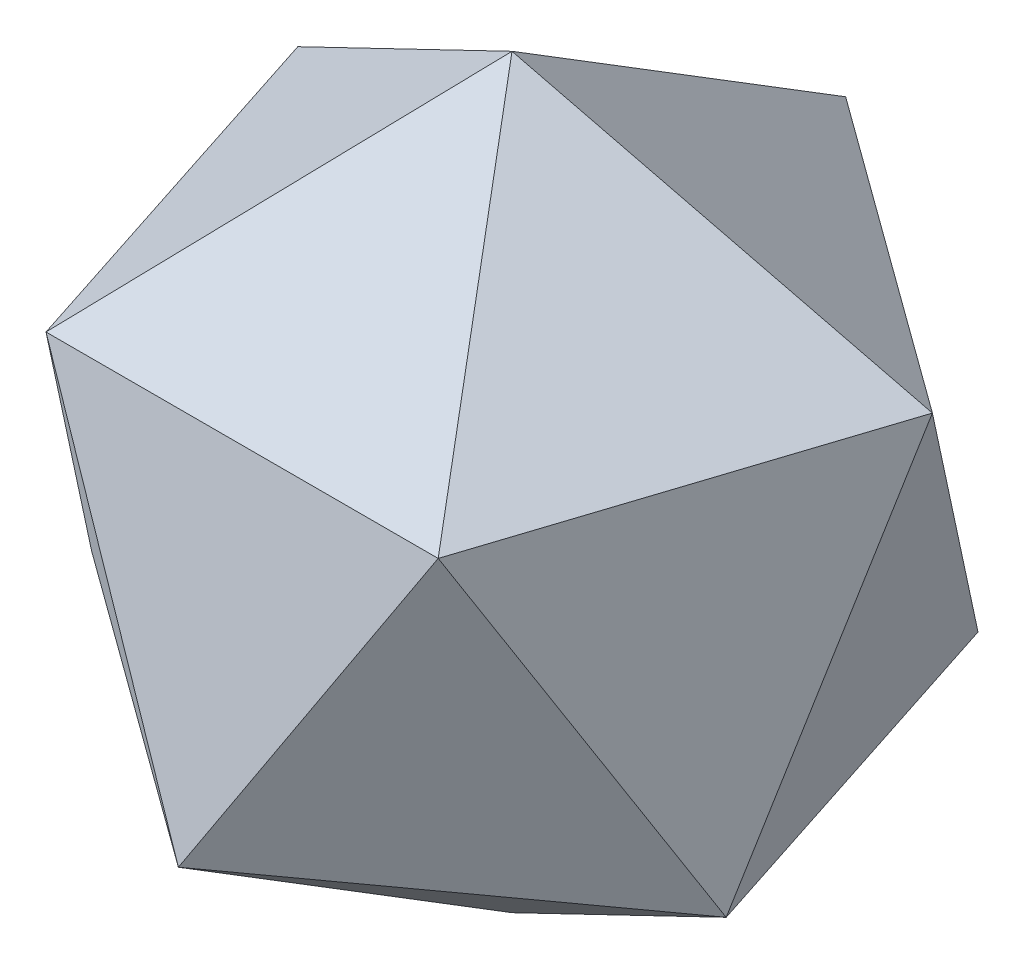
ISO-10303-21;
HEADER;
FILE_DESCRIPTION(('STEP AP214'),'2;1');
FILE_NAME('part.step','',(''),(''),'','','');
FILE_SCHEMA(('AUTOMOTIVE_DESIGN { 1 0 10303 214 1 1 1 1 }'));
ENDSEC;
DATA;
#1=APPLICATION_CONTEXT('core data for automotive mechanical design processes');
#2=APPLICATION_PROTOCOL_DEFINITION('international standard','automotive_design',2000,#1);
#3=PRODUCT_CONTEXT('',#1,'mechanical');
#4=PRODUCT('Part','Part','',(#3));
#5=PRODUCT_RELATED_PRODUCT_CATEGORY('part','',(#4));
#6=PRODUCT_DEFINITION_FORMATION('','',#4);
#7=PRODUCT_DEFINITION_CONTEXT('part definition',#1,'design');
#8=PRODUCT_DEFINITION('design','',#6,#7);
#9=PRODUCT_DEFINITION_SHAPE('','',#8);
#10=(LENGTH_UNIT() NAMED_UNIT(*) SI_UNIT(.MILLI.,.METRE.));
#11=(NAMED_UNIT(*) PLANE_ANGLE_UNIT() SI_UNIT($,.RADIAN.));
#12=(NAMED_UNIT(*) SI_UNIT($,.STERADIAN.) SOLID_ANGLE_UNIT());
#13=UNCERTAINTY_MEASURE_WITH_UNIT(LENGTH_MEASURE(1.E-05),#10,'distance_accuracy_value','');
#14=(GEOMETRIC_REPRESENTATION_CONTEXT(3) GLOBAL_UNCERTAINTY_ASSIGNED_CONTEXT((#13)) GLOBAL_UNIT_ASSIGNED_CONTEXT((#10,
#11,#12)) REPRESENTATION_CONTEXT('',''));
#15=CARTESIAN_POINT('',(0.,0.,0.));
#16=DIRECTION('',(0.,0.,1.));
#17=DIRECTION('',(1.,0.,0.));
#18=AXIS2_PLACEMENT_3D('',#15,#16,#17);
#19=CARTESIAN_POINT('',(-26.9672331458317,-60.056910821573,37.1172121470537));
#20=DIRECTION('',(-0.356822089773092,-0.794654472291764,0.491123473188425));
#21=DIRECTION('',(0.,-0.525731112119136,-0.850650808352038));
#22=AXIS2_PLACEMENT_3D('',#19,#20,#21);
#23=PLANE('',#22);
#24=DIRECTION('',(-0.809016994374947,0.,-0.587785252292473));
#25=VECTOR('',#24,1.);
#26=CARTESIAN_POINT('',(-40.4508497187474,-42.5325404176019,55.6758182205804));
#27=LINE('',#26,#25);
#28=CARTESIAN_POINT('',(0.,-42.5325404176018,85.0650808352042));
#29=VERTEX_POINT('',#28);
#30=CARTESIAN_POINT('',(-80.9016994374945,-42.5325404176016,26.2865556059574));
#31=VERTEX_POINT('',#30);
#32=EDGE_CURVE('E116',#29,#31,#27,.T.);
#33=ORIENTED_EDGE('',*,*,#32,.T.);
#34=DIRECTION('',(0.809016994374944,-0.525731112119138,-0.26286555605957));
#35=VECTOR('',#34,1.);
#36=CARTESIAN_POINT('',(-40.4508497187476,-68.8190960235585,13.1432778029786));
#37=LINE('',#36,#35);
#38=CARTESIAN_POINT('',(0.,-95.1056516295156,0.));
#39=VERTEX_POINT('',#38);
#40=EDGE_CURVE('E55',#31,#39,#37,.T.);
#41=ORIENTED_EDGE('',*,*,#40,.T.);
#42=DIRECTION('',(0.,0.525731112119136,0.850650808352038));
#43=VECTOR('',#42,1.);
#44=CARTESIAN_POINT('',(0.,-68.8190960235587,42.5325404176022));
#45=LINE('',#44,#43);
#46=EDGE_CURVE('E87',#39,#29,#45,.T.);
#47=ORIENTED_EDGE('',*,*,#46,.T.);
#48=EDGE_LOOP('',(#33,#41,#47));
#49=FACE_BOUND('',#48,.T.);
#50=ADVANCED_FACE('F33',(#49),#23,.T.);
#51=CARTESIAN_POINT('',(43.6338998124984,-14.1775134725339,60.056910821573));
#52=DIRECTION('',(-0.577350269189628,0.187592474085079,-0.794654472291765));
#53=DIRECTION('',(-0.809016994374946,0.,0.587785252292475));
#54=AXIS2_PLACEMENT_3D('',#51,#52,#53);
#55=PLANE('',#54);
#56=DIRECTION('',(-0.809016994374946,0.,0.587785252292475));
#57=VECTOR('',#56,1.);
#58=CARTESIAN_POINT('',(40.4508497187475,-42.5325404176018,55.6758182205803));
#59=LINE('',#58,#57);
#60=CARTESIAN_POINT('',(80.901699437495,-42.5325404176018,26.2865556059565));
#61=VERTEX_POINT('',#60);
#62=EDGE_CURVE('E92',#61,#29,#59,.T.);
#63=ORIENTED_EDGE('',*,*,#62,.F.);
#64=DIRECTION('',(-0.309016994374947,0.85065080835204,0.42532540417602));
#65=VECTOR('',#64,1.);
#66=CARTESIAN_POINT('',(65.4508497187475,1.09287578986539E-13,47.5528258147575));
#67=LINE('',#66,#65);
#68=CARTESIAN_POINT('',(50.,42.5325404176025,68.8190960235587));
#69=VERTEX_POINT('',#68);
#70=EDGE_CURVE('E149',#61,#69,#67,.T.);
#71=ORIENTED_EDGE('',*,*,#70,.T.);
#72=DIRECTION('',(0.499999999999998,0.850650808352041,-0.162459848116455));
#73=VECTOR('',#72,1.);
#74=CARTESIAN_POINT('',(25.0000000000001,1.00613961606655E-13,76.9420884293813));
#75=LINE('',#74,#73);
#76=EDGE_CURVE('E152',#29,#69,#75,.T.);
#77=ORIENTED_EDGE('',*,*,#76,.F.);
#78=EDGE_LOOP('',(#63,#71,#77));
#79=FACE_BOUND('',#78,.T.);
#80=ADVANCED_FACE('F204',(#79),#55,.F.);
#81=CARTESIAN_POINT('',(70.6011329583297,-14.1775134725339,-22.9396986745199));
#82=DIRECTION('',(-0.934172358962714,0.187592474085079,0.303530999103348));
#83=DIRECTION('',(0.309016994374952,0.,0.951056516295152));
#84=AXIS2_PLACEMENT_3D('',#81,#82,#83);
#85=PLANE('',#84);
#86=DIRECTION('',(0.309016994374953,0.,0.951056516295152));
#87=VECTOR('',#86,1.);
#88=CARTESIAN_POINT('',(65.4508497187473,-42.5325404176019,-21.2662702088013));
#89=LINE('',#88,#87);
#90=CARTESIAN_POINT('',(49.9999999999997,-42.5325404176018,-68.8190960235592));
#91=VERTEX_POINT('',#90);
#92=EDGE_CURVE('E104',#91,#61,#89,.T.);
#93=ORIENTED_EDGE('',*,*,#92,.F.);
#94=DIRECTION('',(0.309016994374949,0.85065080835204,0.425325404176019));
#95=VECTOR('',#94,1.);
#96=CARTESIAN_POINT('',(65.4508497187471,1.11022302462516E-13,-47.552825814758));
#97=LINE('',#96,#95);
#98=CARTESIAN_POINT('',(80.9016994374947,42.5325404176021,-26.2865556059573));
#99=VERTEX_POINT('',#98);
#100=EDGE_CURVE('E146',#91,#99,#97,.T.);
#101=ORIENTED_EDGE('',*,*,#100,.T.);
#102=DIRECTION('',(0.,-0.850650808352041,0.525731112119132));
#103=VECTOR('',#102,1.);
#104=CARTESIAN_POINT('',(80.9016994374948,1.12757025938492E-13,-3.40005801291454E-13));
#105=LINE('',#104,#103);
#106=EDGE_CURVE('E168',#99,#61,#105,.T.);
#107=ORIENTED_EDGE('',*,*,#106,.T.);
#108=EDGE_LOOP('',(#93,#101,#107));
#109=FACE_BOUND('',#108,.T.);
#110=ADVANCED_FACE('F199',(#109),#85,.F.);
#111=CARTESIAN_POINT('',(-6.10622663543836E-13,-14.1775134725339,-74.2344242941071));
#112=DIRECTION('',(0.,0.187592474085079,0.982246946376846));
#113=DIRECTION('',(1.,0.,0.));
#114=AXIS2_PLACEMENT_3D('',#111,#112,#113);
#115=PLANE('',#114);
#116=DIRECTION('',(1.,0.,0.));
#117=VECTOR('',#116,1.);
#118=CARTESIAN_POINT('',(-5.53973791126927E-13,-42.5325404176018,-68.8190960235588));
#119=LINE('',#118,#117);
#120=CARTESIAN_POINT('',(-50.0000000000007,-42.5325404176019,-68.8190960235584));
#121=VERTEX_POINT('',#120);
#122=EDGE_CURVE('E105',#121,#91,#119,.T.);
#123=ORIENTED_EDGE('',*,*,#122,.F.);
#124=DIRECTION('',(0.499999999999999,0.85065080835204,-0.162459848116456));
#125=VECTOR('',#124,1.);
#126=CARTESIAN_POINT('',(-25.0000000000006,1.00613961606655E-13,-76.9420884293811));
#127=LINE('',#126,#125);
#128=CARTESIAN_POINT('',(-8.44136347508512E-13,42.5325404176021,-85.0650808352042));
#129=VERTEX_POINT('',#128);
#130=EDGE_CURVE('E143',#121,#129,#127,.T.);
#131=ORIENTED_EDGE('',*,*,#130,.T.);
#132=DIRECTION('',(0.5,-0.850650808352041,0.162459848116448));
#133=VECTOR('',#132,1.);
#134=CARTESIAN_POINT('',(24.9999999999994,0.,-76.9420884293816));
#135=LINE('',#134,#133);
#136=EDGE_CURVE('E165',#129,#91,#135,.T.);
#137=ORIENTED_EDGE('',*,*,#136,.T.);
#138=EDGE_LOOP('',(#123,#131,#137));
#139=FACE_BOUND('',#138,.T.);
#140=ADVANCED_FACE('F192',(#139),#115,.F.);
#141=CARTESIAN_POINT('',(-70.6011329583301,-14.1775134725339,-22.9396986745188));
#142=DIRECTION('',(0.934172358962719,0.187592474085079,0.303530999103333));
#143=DIRECTION('',(0.309016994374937,0.,-0.951056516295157));
#144=AXIS2_PLACEMENT_3D('',#141,#142,#143);
#145=PLANE('',#144);
#146=DIRECTION('',(0.309016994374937,0.,-0.951056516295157));
#147=VECTOR('',#146,1.);
#148=CARTESIAN_POINT('',(-65.4508497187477,-42.5325404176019,-21.2662702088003));
#149=LINE('',#148,#147);
#150=EDGE_CURVE('E11',#31,#121,#149,.T.);
#151=ORIENTED_EDGE('',*,*,#150,.F.);
#152=DIRECTION('',(0.,0.85065080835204,-0.525731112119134));
#153=VECTOR('',#152,1.);
#154=CARTESIAN_POINT('',(-80.9016994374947,1.14491749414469E-13,8.81239525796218E-13));
#155=LINE('',#154,#153);
#156=CARTESIAN_POINT('',(-80.901699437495,42.5325404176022,-26.2865556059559));
#157=VERTEX_POINT('',#156);
#158=EDGE_CURVE('E159',#31,#157,#155,.T.);
#159=ORIENTED_EDGE('',*,*,#158,.T.);
#160=DIRECTION('',(0.309016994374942,-0.850650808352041,-0.425325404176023));
#161=VECTOR('',#160,1.);
#162=CARTESIAN_POINT('',(-65.4508497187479,1.09287578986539E-13,-47.552825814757));
#163=LINE('',#162,#161);
#164=EDGE_CURVE('E162',#157,#121,#163,.T.);
#165=ORIENTED_EDGE('',*,*,#164,.T.);
#166=EDGE_LOOP('',(#151,#159,#165));
#167=FACE_BOUND('',#166,.T.);
#168=ADVANCED_FACE('F189',(#167),#145,.F.);
#169=CARTESIAN_POINT('',(0.,14.1775134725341,74.2344242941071));
#170=DIRECTION('',(0.,-0.187592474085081,-0.982246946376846));
#171=DIRECTION('',(0.,0.982246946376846,-0.187592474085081));
#172=AXIS2_PLACEMENT_3D('',#169,#170,#171);
#173=PLANE('',#172);
#174=DIRECTION('',(1.,0.,0.));
#175=VECTOR('',#174,1.);
#176=CARTESIAN_POINT('',(0.,42.5325404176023,68.8190960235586));
#177=LINE('',#176,#175);
#178=CARTESIAN_POINT('',(-49.9999999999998,42.5325404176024,68.8190960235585));
#179=VERTEX_POINT('',#178);
#180=EDGE_CURVE('E130',#179,#69,#177,.T.);
#181=ORIENTED_EDGE('',*,*,#180,.F.);
#182=DIRECTION('',(-0.499999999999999,0.85065080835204,-0.162459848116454));
#183=VECTOR('',#182,1.);
#184=CARTESIAN_POINT('',(-25.,1.05818132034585E-13,76.9420884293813));
#185=LINE('',#184,#183);
#186=EDGE_CURVE('E156',#29,#179,#185,.T.);
#187=ORIENTED_EDGE('',*,*,#186,.F.);
#188=ORIENTED_EDGE('',*,*,#76,.T.);
#189=EDGE_LOOP('',(#181,#187,#188));
#190=FACE_BOUND('',#189,.T.);
#191=ADVANCED_FACE('F191',(#190),#173,.F.);
#192=CARTESIAN_POINT('',(-43.6338998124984,60.0569108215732,14.177513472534));
#193=DIRECTION('',(-0.577350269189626,0.794654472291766,0.18759247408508));
#194=DIRECTION('',(-0.809016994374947,-0.587785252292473,0.));
#195=AXIS2_PLACEMENT_3D('',#192,#193,#194);
#196=PLANE('',#195);
#197=DIRECTION('',(0.499999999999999,0.525731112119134,-0.688190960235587));
#198=VECTOR('',#197,1.);
#199=CARTESIAN_POINT('',(-25.,68.8190960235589,34.4095480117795));
#200=LINE('',#199,#198);
#201=CARTESIAN_POINT('',(0.,95.1056516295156,0.));
#202=VERTEX_POINT('',#201);
#203=EDGE_CURVE('E127',#179,#202,#200,.T.);
#204=ORIENTED_EDGE('',*,*,#203,.T.);
#205=DIRECTION('',(-0.809016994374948,-0.525731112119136,-0.262865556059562));
#206=VECTOR('',#205,1.);
#207=CARTESIAN_POINT('',(-40.4508497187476,68.8190960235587,-13.1432778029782));
#208=LINE('',#207,#206);
#209=EDGE_CURVE('E134',#202,#157,#208,.T.);
#210=ORIENTED_EDGE('',*,*,#209,.T.);
#211=DIRECTION('',(-0.30901699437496,0.,-0.951056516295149));
#212=VECTOR('',#211,1.);
#213=CARTESIAN_POINT('',(-65.4508497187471,42.5325404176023,21.2662702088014));
#214=LINE('',#213,#212);
#215=EDGE_CURVE('E137',#179,#157,#214,.T.);
#216=ORIENTED_EDGE('',*,*,#215,.F.);
#217=EDGE_LOOP('',(#204,#210,#216));
#218=FACE_BOUND('',#217,.T.);
#219=ADVANCED_FACE('F182',(#218),#196,.T.);
#220=CARTESIAN_POINT('',(-43.6338998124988,14.1775134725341,-60.0569108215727));
#221=DIRECTION('',(0.577350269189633,-0.187592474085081,0.794654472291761));
#222=DIRECTION('',(0.11026408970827,0.982246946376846,0.151765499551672));
#223=AXIS2_PLACEMENT_3D('',#220,#221,#222);
#224=PLANE('',#223);
#225=DIRECTION('',(-0.809016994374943,0.,0.58778525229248));
#226=VECTOR('',#225,1.);
#227=CARTESIAN_POINT('',(-40.4508497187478,42.5325404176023,-55.6758182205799));
#228=LINE('',#227,#226);
#229=EDGE_CURVE('E41',#129,#157,#228,.T.);
#230=ORIENTED_EDGE('',*,*,#229,.F.);
#231=ORIENTED_EDGE('',*,*,#130,.F.);
#232=ORIENTED_EDGE('',*,*,#164,.F.);
#233=EDGE_LOOP('',(#230,#231,#232));
#234=FACE_BOUND('',#233,.T.);
#235=ADVANCED_FACE('F183',(#234),#224,.F.);
#236=CARTESIAN_POINT('',(43.6338998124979,14.1775134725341,-60.0569108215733));
#237=DIRECTION('',(-0.577350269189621,-0.187592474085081,0.794654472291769));
#238=DIRECTION('',(-0.110264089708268,0.982246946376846,0.151765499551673));
#239=AXIS2_PLACEMENT_3D('',#236,#237,#238);
#240=PLANE('',#239);
#241=DIRECTION('',(-0.809016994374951,0.,-0.587785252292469));
#242=VECTOR('',#241,1.);
#243=CARTESIAN_POINT('',(40.4508497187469,42.5325404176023,-55.6758182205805));
#244=LINE('',#243,#242);
#245=EDGE_CURVE('E132',#99,#129,#244,.T.);
#246=ORIENTED_EDGE('',*,*,#245,.F.);
#247=ORIENTED_EDGE('',*,*,#100,.F.);
#248=ORIENTED_EDGE('',*,*,#136,.F.);
#249=EDGE_LOOP('',(#246,#247,#248));
#250=FACE_BOUND('',#249,.T.);
#251=ADVANCED_FACE('F217',(#250),#240,.F.);
#252=CARTESIAN_POINT('',(70.6011329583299,14.1775134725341,22.9396986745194));
#253=DIRECTION('',(-0.934172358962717,-0.187592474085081,-0.30353099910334));
#254=DIRECTION('',(-0.178411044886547,0.982246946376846,-0.0579692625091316));
#255=AXIS2_PLACEMENT_3D('',#252,#253,#254);
#256=PLANE('',#255);
#257=DIRECTION('',(0.309016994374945,0.,-0.951056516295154));
#258=VECTOR('',#257,1.);
#259=CARTESIAN_POINT('',(65.4508497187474,42.5325404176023,21.2662702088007));
#260=LINE('',#259,#258);
#261=EDGE_CURVE('E171',#69,#99,#260,.T.);
#262=ORIENTED_EDGE('',*,*,#261,.F.);
#263=ORIENTED_EDGE('',*,*,#70,.F.);
#264=ORIENTED_EDGE('',*,*,#106,.F.);
#265=EDGE_LOOP('',(#262,#263,#264));
#266=FACE_BOUND('',#265,.T.);
#267=ADVANCED_FACE('F222',(#266),#256,.F.);
#268=CARTESIAN_POINT('',(-43.6338998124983,-14.1775134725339,60.0569108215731));
#269=DIRECTION('',(0.577350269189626,0.187592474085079,-0.794654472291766));
#270=DIRECTION('',(-0.809016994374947,0.,-0.587785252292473));
#271=AXIS2_PLACEMENT_3D('',#268,#269,#270);
#272=PLANE('',#271);
#273=ORIENTED_EDGE('',*,*,#186,.T.);
#274=DIRECTION('',(-0.309016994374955,-0.850650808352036,-0.425325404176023));
#275=VECTOR('',#274,1.);
#276=CARTESIAN_POINT('',(-65.450849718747,1.05818132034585E-13,47.552825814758));
#277=LINE('',#276,#275);
#278=EDGE_CURVE('E140',#179,#31,#277,.T.);
#279=ORIENTED_EDGE('',*,*,#278,.T.);
#280=ORIENTED_EDGE('',*,*,#32,.F.);
#281=EDGE_LOOP('',(#273,#279,#280));
#282=FACE_BOUND('',#281,.T.);
#283=ADVANCED_FACE('F35',(#282),#272,.F.);
#284=CARTESIAN_POINT('',(-70.6011329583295,14.1775134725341,22.9396986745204));
#285=DIRECTION('',(0.934172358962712,-0.187592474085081,-0.303530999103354));
#286=DIRECTION('',(0.178411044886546,0.982246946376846,-0.0579692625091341));
#287=AXIS2_PLACEMENT_3D('',#284,#285,#286);
#288=PLANE('',#287);
#289=ORIENTED_EDGE('',*,*,#215,.T.);
#290=ORIENTED_EDGE('',*,*,#158,.F.);
#291=ORIENTED_EDGE('',*,*,#278,.F.);
#292=EDGE_LOOP('',(#289,#290,#291));
#293=FACE_BOUND('',#292,.T.);
#294=ADVANCED_FACE('F188',(#293),#288,.F.);
#295=CARTESIAN_POINT('',(43.6338998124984,60.0569108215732,14.1775134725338));
#296=DIRECTION('',(0.577350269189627,0.794654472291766,0.187592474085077));
#297=DIRECTION('',(0.654508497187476,-0.587785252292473,0.475528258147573));
#298=AXIS2_PLACEMENT_3D('',#295,#296,#297);
#299=PLANE('',#298);
#300=ORIENTED_EDGE('',*,*,#261,.T.);
#301=DIRECTION('',(-0.809016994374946,0.525731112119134,0.262865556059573));
#302=VECTOR('',#301,1.);
#303=CARTESIAN_POINT('',(40.4508497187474,68.8190960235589,-13.1432778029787));
#304=LINE('',#303,#302);
#305=EDGE_CURVE('E124',#99,#202,#304,.T.);
#306=ORIENTED_EDGE('',*,*,#305,.T.);
#307=DIRECTION('',(-0.500000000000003,0.525731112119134,-0.688190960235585));
#308=VECTOR('',#307,1.);
#309=CARTESIAN_POINT('',(25.0000000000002,68.8190960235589,34.4095480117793));
#310=LINE('',#309,#308);
#311=EDGE_CURVE('E48',#69,#202,#310,.T.);
#312=ORIENTED_EDGE('',*,*,#311,.F.);
#313=EDGE_LOOP('',(#300,#306,#312));
#314=FACE_BOUND('',#313,.T.);
#315=ADVANCED_FACE('F248',(#314),#299,.T.);
#316=CARTESIAN_POINT('',(26.9672331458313,60.0569108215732,-37.1172121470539));
#317=DIRECTION('',(0.356822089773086,0.794654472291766,-0.491123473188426));
#318=DIRECTION('',(0.654508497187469,-0.587785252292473,-0.475528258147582));
#319=AXIS2_PLACEMENT_3D('',#316,#317,#318);
#320=PLANE('',#319);
#321=ORIENTED_EDGE('',*,*,#245,.T.);
#322=DIRECTION('',(0.,0.525731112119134,0.85065080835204));
#323=VECTOR('',#322,1.);
#324=CARTESIAN_POINT('',(-4.1286418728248E-13,68.8190960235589,-42.5325404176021));
#325=LINE('',#324,#323);
#326=EDGE_CURVE('E96',#129,#202,#325,.T.);
#327=ORIENTED_EDGE('',*,*,#326,.T.);
#328=ORIENTED_EDGE('',*,*,#305,.F.);
#329=EDGE_LOOP('',(#321,#327,#328));
#330=FACE_BOUND('',#329,.T.);
#331=ADVANCED_FACE('F242',(#330),#320,.T.);
#332=CARTESIAN_POINT('',(1.196959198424E-13,60.0569108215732,45.8793973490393));
#333=DIRECTION('',(0.,0.794654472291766,0.607061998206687));
#334=DIRECTION('',(-0.249999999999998,-0.587785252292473,0.769420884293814));
#335=AXIS2_PLACEMENT_3D('',#332,#333,#334);
#336=PLANE('',#335);
#337=ORIENTED_EDGE('',*,*,#180,.T.);
#338=ORIENTED_EDGE('',*,*,#311,.T.);
#339=ORIENTED_EDGE('',*,*,#203,.F.);
#340=EDGE_LOOP('',(#337,#338,#339));
#341=FACE_BOUND('',#340,.T.);
#342=ADVANCED_FACE('F240',(#341),#336,.T.);
#343=CARTESIAN_POINT('',(-26.9672331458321,60.0569108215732,-37.1172121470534));
#344=DIRECTION('',(-0.356822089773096,0.794654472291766,-0.491123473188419));
#345=DIRECTION('',(-0.250000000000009,-0.587785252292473,-0.76942088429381));
#346=AXIS2_PLACEMENT_3D('',#343,#344,#345);
#347=PLANE('',#346);
#348=ORIENTED_EDGE('',*,*,#326,.F.);
#349=ORIENTED_EDGE('',*,*,#229,.T.);
#350=ORIENTED_EDGE('',*,*,#209,.F.);
#351=EDGE_LOOP('',(#348,#349,#350));
#352=FACE_BOUND('',#351,.T.);
#353=ADVANCED_FACE('F175',(#352),#347,.T.);
#354=CARTESIAN_POINT('',(43.6338998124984,-60.056910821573,-14.1775134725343));
#355=DIRECTION('',(0.577350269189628,-0.794654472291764,-0.187592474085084));
#356=DIRECTION('',(-0.499999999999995,-0.525731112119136,0.688190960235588));
#357=AXIS2_PLACEMENT_3D('',#354,#355,#356);
#358=PLANE('',#357);
#359=ORIENTED_EDGE('',*,*,#92,.T.);
#360=DIRECTION('',(0.809016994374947,0.525731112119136,0.262865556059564));
#361=VECTOR('',#360,1.);
#362=CARTESIAN_POINT('',(40.4508497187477,-68.8190960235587,13.1432778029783));
#363=LINE('',#362,#361);
#364=EDGE_CURVE('E90',#39,#61,#363,.T.);
#365=ORIENTED_EDGE('',*,*,#364,.F.);
#366=DIRECTION('',(0.499999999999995,0.525731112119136,-0.688190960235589));
#367=VECTOR('',#366,1.);
#368=CARTESIAN_POINT('',(24.9999999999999,-68.8190960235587,-34.4095480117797));
#369=LINE('',#368,#367);
#370=EDGE_CURVE('E102',#39,#91,#369,.T.);
#371=ORIENTED_EDGE('',*,*,#370,.T.);
#372=EDGE_LOOP('',(#359,#365,#371));
#373=FACE_BOUND('',#372,.T.);
#374=ADVANCED_FACE('F101',(#373),#358,.T.);
#375=CARTESIAN_POINT('',(-3.64291929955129E-13,-60.056910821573,-45.8793973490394));
#376=DIRECTION('',(0.,-0.794654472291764,-0.607061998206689));
#377=DIRECTION('',(0.500000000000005,-0.525731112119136,0.688190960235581));
#378=AXIS2_PLACEMENT_3D('',#375,#376,#377);
#379=PLANE('',#378);
#380=ORIENTED_EDGE('',*,*,#122,.T.);
#381=ORIENTED_EDGE('',*,*,#370,.F.);
#382=DIRECTION('',(-0.500000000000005,0.525731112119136,-0.688190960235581));
#383=VECTOR('',#382,1.);
#384=CARTESIAN_POINT('',(-25.0000000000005,-68.8190960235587,-34.4095480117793));
#385=LINE('',#384,#383);
#386=EDGE_CURVE('E110',#39,#121,#385,.T.);
#387=ORIENTED_EDGE('',*,*,#386,.T.);
#388=EDGE_LOOP('',(#380,#381,#387));
#389=FACE_BOUND('',#388,.T.);
#390=ADVANCED_FACE('F109',(#389),#379,.T.);
#391=CARTESIAN_POINT('',(-43.6338998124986,-60.056910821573,-14.1775134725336));
#392=DIRECTION('',(-0.57735026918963,-0.794654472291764,-0.187592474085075));
#393=DIRECTION('',(0.809016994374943,-0.525731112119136,-0.262865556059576));
#394=AXIS2_PLACEMENT_3D('',#391,#392,#393);
#395=PLANE('',#394);
#396=ORIENTED_EDGE('',*,*,#150,.T.);
#397=ORIENTED_EDGE('',*,*,#386,.F.);
#398=ORIENTED_EDGE('',*,*,#40,.F.);
#399=EDGE_LOOP('',(#396,#397,#398));
#400=FACE_BOUND('',#399,.T.);
#401=ADVANCED_FACE('F113',(#400),#395,.T.);
#402=CARTESIAN_POINT('',(26.9672331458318,-60.056910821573,37.1172121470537));
#403=DIRECTION('',(0.356822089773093,-0.794654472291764,0.491123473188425));
#404=DIRECTION('',(-0.809016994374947,-0.525731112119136,-0.262865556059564));
#405=AXIS2_PLACEMENT_3D('',#402,#403,#404);
#406=PLANE('',#405);
#407=ORIENTED_EDGE('',*,*,#364,.T.);
#408=ORIENTED_EDGE('',*,*,#62,.T.);
#409=ORIENTED_EDGE('',*,*,#46,.F.);
#410=EDGE_LOOP('',(#407,#408,#409));
#411=FACE_BOUND('',#410,.T.);
#412=ADVANCED_FACE('F89',(#411),#406,.T.);
#413=CLOSED_SHELL('',(#50,#80,#110,#140,#168,#191,#219,#235,#251,#267,#283,#294,#315,#331,#342,
#353,#374,#390,#401,#412));
#414=MANIFOLD_SOLID_BREP('B2',#413);
#415=ADVANCED_BREP_SHAPE_REPRESENTATION('',(#18,#414),#14);
#416=SHAPE_DEFINITION_REPRESENTATION(#9,#415);
ENDSEC;
END-ISO-10303-21;
